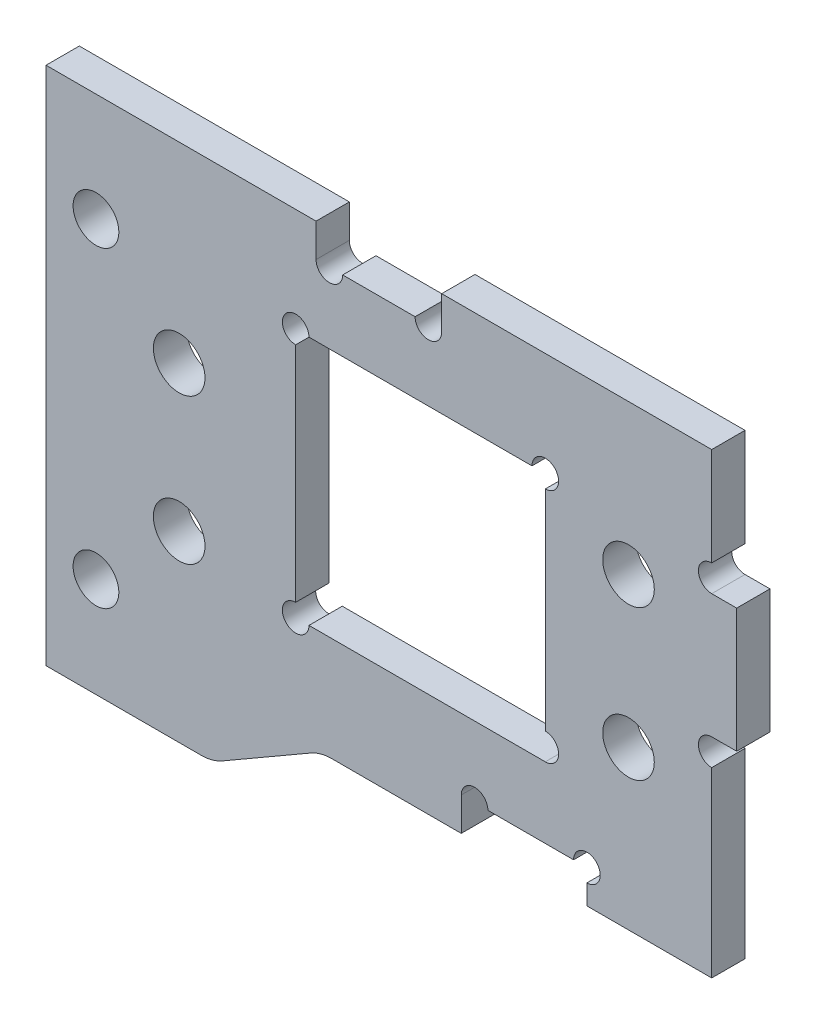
ISO-10303-21;
HEADER;
FILE_DESCRIPTION(('STEP AP214'),'2;1');
FILE_NAME('part.step','',(''),(''),'','','');
FILE_SCHEMA(('AUTOMOTIVE_DESIGN { 1 0 10303 214 1 1 1 1 }'));
ENDSEC;
DATA;
#1=APPLICATION_CONTEXT('core data for automotive mechanical design processes');
#2=APPLICATION_PROTOCOL_DEFINITION('international standard','automotive_design',2000,#1);
#3=PRODUCT_CONTEXT('',#1,'mechanical');
#4=PRODUCT('Part','Part','',(#3));
#5=PRODUCT_RELATED_PRODUCT_CATEGORY('part','',(#4));
#6=PRODUCT_DEFINITION_FORMATION('','',#4);
#7=PRODUCT_DEFINITION_CONTEXT('part definition',#1,'design');
#8=PRODUCT_DEFINITION('design','',#6,#7);
#9=PRODUCT_DEFINITION_SHAPE('','',#8);
#10=(LENGTH_UNIT() NAMED_UNIT(*) SI_UNIT(.MILLI.,.METRE.));
#11=(NAMED_UNIT(*) PLANE_ANGLE_UNIT() SI_UNIT($,.RADIAN.));
#12=(NAMED_UNIT(*) SI_UNIT($,.STERADIAN.) SOLID_ANGLE_UNIT());
#13=UNCERTAINTY_MEASURE_WITH_UNIT(LENGTH_MEASURE(1.E-05),#10,'distance_accuracy_value','');
#14=(GEOMETRIC_REPRESENTATION_CONTEXT(3) GLOBAL_UNCERTAINTY_ASSIGNED_CONTEXT((#13)) GLOBAL_UNIT_ASSIGNED_CONTEXT((#10,
#11,#12)) REPRESENTATION_CONTEXT('',''));
#15=CARTESIAN_POINT('',(0.,0.,0.));
#16=DIRECTION('',(0.,0.,1.));
#17=DIRECTION('',(1.,0.,0.));
#18=AXIS2_PLACEMENT_3D('',#15,#16,#17);
#19=CARTESIAN_POINT('',(40.,-0.25,-6.));
#20=DIRECTION('',(0.,0.,1.));
#21=DIRECTION('',(1.,0.,0.));
#22=AXIS2_PLACEMENT_3D('',#19,#20,#21);
#23=CYLINDRICAL_SURFACE('',#22,1.6);
#24=CARTESIAN_POINT('',(40.,-0.25,0.));
#25=DIRECTION('',(0.,0.,1.));
#26=DIRECTION('',(1.,0.,0.));
#27=AXIS2_PLACEMENT_3D('',#24,#25,#26);
#28=CIRCLE('',#27,1.6);
#29=CARTESIAN_POINT('',(40.,1.35,0.));
#30=VERTEX_POINT('',#29);
#31=CARTESIAN_POINT('',(40.,-1.85,0.));
#32=VERTEX_POINT('',#31);
#33=EDGE_CURVE('E379',#30,#32,#28,.T.);
#34=ORIENTED_EDGE('',*,*,#33,.F.);
#35=DIRECTION('',(0.,0.,-1.));
#36=VECTOR('',#35,1.);
#37=CARTESIAN_POINT('',(40.,1.35,4.));
#38=LINE('',#37,#36);
#39=CARTESIAN_POINT('',(40.,1.35,4.));
#40=VERTEX_POINT('',#39);
#41=EDGE_CURVE('E465',#40,#30,#38,.T.);
#42=ORIENTED_EDGE('',*,*,#41,.F.);
#43=CARTESIAN_POINT('',(40.,-0.25,4.));
#44=DIRECTION('',(0.,0.,1.));
#45=DIRECTION('',(1.,0.,0.));
#46=AXIS2_PLACEMENT_3D('',#43,#44,#45);
#47=CIRCLE('',#46,1.6);
#48=CARTESIAN_POINT('',(40.,-1.85,4.));
#49=VERTEX_POINT('',#48);
#50=EDGE_CURVE('E643',#40,#49,#47,.T.);
#51=ORIENTED_EDGE('',*,*,#50,.T.);
#52=DIRECTION('',(0.,0.,1.));
#53=VECTOR('',#52,1.);
#54=CARTESIAN_POINT('',(40.,-1.85,-6.));
#55=LINE('',#54,#53);
#56=EDGE_CURVE('E605',#32,#49,#55,.T.);
#57=ORIENTED_EDGE('',*,*,#56,.F.);
#58=EDGE_LOOP('',(#34,#42,#51,#57));
#59=FACE_BOUND('',#58,.T.);
#60=ADVANCED_FACE('F17',(#59),#23,.F.);
#61=CARTESIAN_POINT('',(40.,17.85,-6.));
#62=DIRECTION('',(0.,0.,1.));
#63=DIRECTION('',(1.,0.,0.));
#64=AXIS2_PLACEMENT_3D('',#61,#62,#63);
#65=CYLINDRICAL_SURFACE('',#64,1.6);
#66=CARTESIAN_POINT('',(40.,17.85,0.));
#67=DIRECTION('',(0.,0.,1.));
#68=DIRECTION('',(1.,0.,0.));
#69=AXIS2_PLACEMENT_3D('',#66,#67,#68);
#70=CIRCLE('',#69,1.6);
#71=CARTESIAN_POINT('',(40.,19.45,0.));
#72=VERTEX_POINT('',#71);
#73=CARTESIAN_POINT('',(40.,16.25,0.));
#74=VERTEX_POINT('',#73);
#75=EDGE_CURVE('E452',#72,#74,#70,.T.);
#76=ORIENTED_EDGE('',*,*,#75,.F.);
#77=DIRECTION('',(0.,0.,-1.));
#78=VECTOR('',#77,1.);
#79=CARTESIAN_POINT('',(40.,19.45,-6.));
#80=LINE('',#79,#78);
#81=CARTESIAN_POINT('',(40.,19.45,4.));
#82=VERTEX_POINT('',#81);
#83=EDGE_CURVE('E437',#82,#72,#80,.T.);
#84=ORIENTED_EDGE('',*,*,#83,.F.);
#85=CARTESIAN_POINT('',(40.,17.85,4.));
#86=DIRECTION('',(0.,0.,1.));
#87=DIRECTION('',(1.,0.,0.));
#88=AXIS2_PLACEMENT_3D('',#85,#86,#87);
#89=CIRCLE('',#88,1.6);
#90=CARTESIAN_POINT('',(40.,16.25,4.));
#91=VERTEX_POINT('',#90);
#92=EDGE_CURVE('E336',#82,#91,#89,.T.);
#93=ORIENTED_EDGE('',*,*,#92,.T.);
#94=DIRECTION('',(0.,0.,-1.));
#95=VECTOR('',#94,1.);
#96=CARTESIAN_POINT('',(40.,16.25,4.));
#97=LINE('',#96,#95);
#98=EDGE_CURVE('E472',#91,#74,#97,.T.);
#99=ORIENTED_EDGE('',*,*,#98,.T.);
#100=EDGE_LOOP('',(#76,#84,#93,#99));
#101=FACE_BOUND('',#100,.T.);
#102=ADVANCED_FACE('F674',(#101),#65,.F.);
#103=CARTESIAN_POINT('',(5.95,27.25,-6.));
#104=DIRECTION('',(0.,0.,1.));
#105=DIRECTION('',(1.,0.,0.));
#106=AXIS2_PLACEMENT_3D('',#103,#104,#105);
#107=CYLINDRICAL_SURFACE('',#106,1.6);
#108=DIRECTION('',(0.,0.,1.));
#109=VECTOR('',#108,1.);
#110=CARTESIAN_POINT('',(4.35,27.25,-6.));
#111=LINE('',#110,#109);
#112=CARTESIAN_POINT('',(4.35,27.25,0.));
#113=VERTEX_POINT('',#112);
#114=CARTESIAN_POINT('',(4.35,27.25,4.));
#115=VERTEX_POINT('',#114);
#116=EDGE_CURVE('E483',#113,#115,#111,.T.);
#117=ORIENTED_EDGE('',*,*,#116,.T.);
#118=CARTESIAN_POINT('',(5.95,27.25,4.));
#119=DIRECTION('',(0.,0.,1.));
#120=DIRECTION('',(1.,0.,0.));
#121=AXIS2_PLACEMENT_3D('',#118,#119,#120);
#122=CIRCLE('',#121,1.6);
#123=CARTESIAN_POINT('',(7.55,27.25,4.));
#124=VERTEX_POINT('',#123);
#125=EDGE_CURVE('E356',#115,#124,#122,.T.);
#126=ORIENTED_EDGE('',*,*,#125,.T.);
#127=DIRECTION('',(0.,0.,-1.));
#128=VECTOR('',#127,1.);
#129=CARTESIAN_POINT('',(7.55,27.25,4.));
#130=LINE('',#129,#128);
#131=CARTESIAN_POINT('',(7.55,27.25,0.));
#132=VERTEX_POINT('',#131);
#133=EDGE_CURVE('E479',#124,#132,#130,.T.);
#134=ORIENTED_EDGE('',*,*,#133,.T.);
#135=CARTESIAN_POINT('',(5.95,27.25,0.));
#136=DIRECTION('',(0.,0.,1.));
#137=DIRECTION('',(1.,0.,0.));
#138=AXIS2_PLACEMENT_3D('',#135,#136,#137);
#139=CIRCLE('',#138,1.6);
#140=EDGE_CURVE('E421',#113,#132,#139,.T.);
#141=ORIENTED_EDGE('',*,*,#140,.F.);
#142=EDGE_LOOP('',(#117,#126,#134,#141));
#143=FACE_BOUND('',#142,.T.);
#144=ADVANCED_FACE('F693',(#143),#107,.F.);
#145=CARTESIAN_POINT('',(-5.95,27.25,-6.));
#146=DIRECTION('',(0.,0.,1.));
#147=DIRECTION('',(1.,0.,0.));
#148=AXIS2_PLACEMENT_3D('',#145,#146,#147);
#149=CYLINDRICAL_SURFACE('',#148,1.6);
#150=DIRECTION('',(0.,0.,-1.));
#151=VECTOR('',#150,1.);
#152=CARTESIAN_POINT('',(-4.35,27.25,-6.));
#153=LINE('',#152,#151);
#154=CARTESIAN_POINT('',(-4.35,27.25,4.));
#155=VERTEX_POINT('',#154);
#156=CARTESIAN_POINT('',(-4.35,27.25,0.));
#157=VERTEX_POINT('',#156);
#158=EDGE_CURVE('E482',#155,#157,#153,.T.);
#159=ORIENTED_EDGE('',*,*,#158,.T.);
#160=CARTESIAN_POINT('',(-5.95,27.25,0.));
#161=DIRECTION('',(0.,0.,1.));
#162=DIRECTION('',(1.,0.,0.));
#163=AXIS2_PLACEMENT_3D('',#160,#161,#162);
#164=CIRCLE('',#163,1.6);
#165=CARTESIAN_POINT('',(-7.55,27.25,0.));
#166=VERTEX_POINT('',#165);
#167=EDGE_CURVE('E422',#166,#157,#164,.T.);
#168=ORIENTED_EDGE('',*,*,#167,.F.);
#169=DIRECTION('',(0.,0.,-1.));
#170=VECTOR('',#169,1.);
#171=CARTESIAN_POINT('',(-7.55,27.25,4.));
#172=LINE('',#171,#170);
#173=CARTESIAN_POINT('',(-7.55,27.25,4.));
#174=VERTEX_POINT('',#173);
#175=EDGE_CURVE('E489',#174,#166,#172,.T.);
#176=ORIENTED_EDGE('',*,*,#175,.F.);
#177=CARTESIAN_POINT('',(-5.95,27.25,4.));
#178=DIRECTION('',(0.,0.,1.));
#179=DIRECTION('',(1.,0.,0.));
#180=AXIS2_PLACEMENT_3D('',#177,#178,#179);
#181=CIRCLE('',#180,1.6);
#182=EDGE_CURVE('E357',#174,#155,#181,.T.);
#183=ORIENTED_EDGE('',*,*,#182,.T.);
#184=EDGE_LOOP('',(#159,#168,#176,#183));
#185=FACE_BOUND('',#184,.T.);
#186=ADVANCED_FACE('F815',(#185),#149,.F.);
#187=CARTESIAN_POINT('',(11.5,-19.75,-6.));
#188=DIRECTION('',(0.,0.,1.));
#189=DIRECTION('',(1.,0.,0.));
#190=AXIS2_PLACEMENT_3D('',#187,#188,#189);
#191=CYLINDRICAL_SURFACE('',#190,1.6);
#192=CARTESIAN_POINT('',(11.5,-19.75,0.));
#193=DIRECTION('',(0.,0.,1.));
#194=DIRECTION('',(1.,0.,0.));
#195=AXIS2_PLACEMENT_3D('',#192,#193,#194);
#196=CIRCLE('',#195,1.6);
#197=CARTESIAN_POINT('',(13.1,-19.75,0.));
#198=VERTEX_POINT('',#197);
#199=CARTESIAN_POINT('',(9.9,-19.75,0.));
#200=VERTEX_POINT('',#199);
#201=EDGE_CURVE('E621',#198,#200,#196,.T.);
#202=ORIENTED_EDGE('',*,*,#201,.F.);
#203=DIRECTION('',(0.,0.,-1.));
#204=VECTOR('',#203,1.);
#205=CARTESIAN_POINT('',(13.1,-19.75,-6.));
#206=LINE('',#205,#204);
#207=CARTESIAN_POINT('',(13.1,-19.75,4.));
#208=VERTEX_POINT('',#207);
#209=EDGE_CURVE('E507',#208,#198,#206,.T.);
#210=ORIENTED_EDGE('',*,*,#209,.F.);
#211=CARTESIAN_POINT('',(11.5,-19.75,4.));
#212=DIRECTION('',(0.,0.,1.));
#213=DIRECTION('',(1.,0.,0.));
#214=AXIS2_PLACEMENT_3D('',#211,#212,#213);
#215=CIRCLE('',#214,1.6);
#216=CARTESIAN_POINT('',(9.9,-19.75,4.));
#217=VERTEX_POINT('',#216);
#218=EDGE_CURVE('E394',#208,#217,#215,.T.);
#219=ORIENTED_EDGE('',*,*,#218,.T.);
#220=DIRECTION('',(0.,0.,1.));
#221=VECTOR('',#220,1.);
#222=CARTESIAN_POINT('',(9.9,-19.75,0.));
#223=LINE('',#222,#221);
#224=EDGE_CURVE('E504',#200,#217,#223,.T.);
#225=ORIENTED_EDGE('',*,*,#224,.F.);
#226=EDGE_LOOP('',(#202,#210,#219,#225));
#227=FACE_BOUND('',#226,.T.);
#228=ADVANCED_FACE('F807',(#227),#191,.F.);
#229=CARTESIAN_POINT('',(-10.,18.75,-6.));
#230=DIRECTION('',(0.,0.,1.));
#231=DIRECTION('',(1.,0.,0.));
#232=AXIS2_PLACEMENT_3D('',#229,#230,#231);
#233=CYLINDRICAL_SURFACE('',#232,1.6);
#234=CARTESIAN_POINT('',(-10.,18.75,0.));
#235=DIRECTION('',(0.,0.,1.));
#236=DIRECTION('',(1.,0.,0.));
#237=AXIS2_PLACEMENT_3D('',#234,#235,#236);
#238=CIRCLE('',#237,1.6);
#239=CARTESIAN_POINT('',(-8.4,18.75,0.));
#240=VERTEX_POINT('',#239);
#241=CARTESIAN_POINT('',(-10.,17.15,0.));
#242=VERTEX_POINT('',#241);
#243=EDGE_CURVE('E319',#240,#242,#238,.T.);
#244=ORIENTED_EDGE('',*,*,#243,.F.);
#245=DIRECTION('',(0.,0.,-1.));
#246=VECTOR('',#245,1.);
#247=CARTESIAN_POINT('',(-8.4,18.75,-6.));
#248=LINE('',#247,#246);
#249=CARTESIAN_POINT('',(-8.4,18.75,4.));
#250=VERTEX_POINT('',#249);
#251=EDGE_CURVE('E305',#250,#240,#248,.T.);
#252=ORIENTED_EDGE('',*,*,#251,.F.);
#253=CARTESIAN_POINT('',(-10.,18.75,4.));
#254=DIRECTION('',(0.,0.,1.));
#255=DIRECTION('',(1.,0.,0.));
#256=AXIS2_PLACEMENT_3D('',#253,#254,#255);
#257=CIRCLE('',#256,1.6);
#258=CARTESIAN_POINT('',(-10.,17.15,4.));
#259=VERTEX_POINT('',#258);
#260=EDGE_CURVE('E399',#250,#259,#257,.T.);
#261=ORIENTED_EDGE('',*,*,#260,.T.);
#262=DIRECTION('',(0.,0.,1.));
#263=VECTOR('',#262,1.);
#264=CARTESIAN_POINT('',(-10.,17.15,-6.));
#265=LINE('',#264,#263);
#266=EDGE_CURVE('E285',#242,#259,#265,.T.);
#267=ORIENTED_EDGE('',*,*,#266,.F.);
#268=EDGE_LOOP('',(#244,#252,#261,#267));
#269=FACE_BOUND('',#268,.T.);
#270=ADVANCED_FACE('F805',(#269),#233,.F.);
#271=CARTESIAN_POINT('',(-10.,-11.25,-6.));
#272=DIRECTION('',(0.,0.,1.));
#273=DIRECTION('',(1.,0.,0.));
#274=AXIS2_PLACEMENT_3D('',#271,#272,#273);
#275=CYLINDRICAL_SURFACE('',#274,1.6);
#276=CARTESIAN_POINT('',(-10.,-11.25,4.));
#277=DIRECTION('',(0.,0.,1.));
#278=DIRECTION('',(1.,0.,0.));
#279=AXIS2_PLACEMENT_3D('',#276,#277,#278);
#280=CIRCLE('',#279,1.6);
#281=CARTESIAN_POINT('',(-10.,-9.65,4.));
#282=VERTEX_POINT('',#281);
#283=CARTESIAN_POINT('',(-8.4,-11.25,4.));
#284=VERTEX_POINT('',#283);
#285=EDGE_CURVE('E348',#282,#284,#280,.T.);
#286=ORIENTED_EDGE('',*,*,#285,.T.);
#287=DIRECTION('',(0.,0.,1.));
#288=VECTOR('',#287,1.);
#289=CARTESIAN_POINT('',(-8.4,-11.25,-6.));
#290=LINE('',#289,#288);
#291=CARTESIAN_POINT('',(-8.4,-11.25,0.));
#292=VERTEX_POINT('',#291);
#293=EDGE_CURVE('E26',#292,#284,#290,.T.);
#294=ORIENTED_EDGE('',*,*,#293,.F.);
#295=CARTESIAN_POINT('',(-10.,-11.25,0.));
#296=DIRECTION('',(0.,0.,1.));
#297=DIRECTION('',(1.,0.,0.));
#298=AXIS2_PLACEMENT_3D('',#295,#296,#297);
#299=CIRCLE('',#298,1.6);
#300=CARTESIAN_POINT('',(-10.,-9.65,0.));
#301=VERTEX_POINT('',#300);
#302=EDGE_CURVE('E308',#301,#292,#299,.T.);
#303=ORIENTED_EDGE('',*,*,#302,.F.);
#304=DIRECTION('',(0.,0.,-1.));
#305=VECTOR('',#304,1.);
#306=CARTESIAN_POINT('',(-10.,-9.65,-6.));
#307=LINE('',#306,#305);
#308=EDGE_CURVE('E293',#282,#301,#307,.T.);
#309=ORIENTED_EDGE('',*,*,#308,.F.);
#310=EDGE_LOOP('',(#286,#294,#303,#309));
#311=FACE_BOUND('',#310,.T.);
#312=ADVANCED_FACE('F309',(#311),#275,.F.);
#313=CARTESIAN_POINT('',(-10.,-11.25,0.));
#314=DIRECTION('',(0.,-1.,0.));
#315=DIRECTION('',(0.,0.,-1.));
#316=AXIS2_PLACEMENT_3D('',#313,#314,#315);
#317=PLANE('',#316);
#318=DIRECTION('',(1.,0.,0.));
#319=VECTOR('',#318,1.);
#320=CARTESIAN_POINT('',(-10.,-11.25,0.));
#321=LINE('',#320,#319);
#322=CARTESIAN_POINT('',(20.,-11.25,0.));
#323=VERTEX_POINT('',#322);
#324=EDGE_CURVE('E314',#292,#323,#321,.T.);
#325=ORIENTED_EDGE('',*,*,#324,.F.);
#326=ORIENTED_EDGE('',*,*,#293,.T.);
#327=DIRECTION('',(1.,0.,0.));
#328=VECTOR('',#327,1.);
#329=CARTESIAN_POINT('',(-10.,-11.25,4.));
#330=LINE('',#329,#328);
#331=CARTESIAN_POINT('',(20.,-11.25,4.));
#332=VERTEX_POINT('',#331);
#333=EDGE_CURVE('E413',#284,#332,#330,.T.);
#334=ORIENTED_EDGE('',*,*,#333,.T.);
#335=DIRECTION('',(0.,0.,1.));
#336=VECTOR('',#335,1.);
#337=CARTESIAN_POINT('',(20.,-11.25,0.));
#338=LINE('',#337,#336);
#339=EDGE_CURVE('E11',#323,#332,#338,.T.);
#340=ORIENTED_EDGE('',*,*,#339,.F.);
#341=EDGE_LOOP('',(#325,#326,#334,#340));
#342=FACE_BOUND('',#341,.T.);
#343=ADVANCED_FACE('F524',(#342),#317,.F.);
#344=CARTESIAN_POINT('',(20.,18.75,0.));
#345=DIRECTION('',(1.,0.,0.));
#346=DIRECTION('',(0.,1.,0.));
#347=AXIS2_PLACEMENT_3D('',#344,#345,#346);
#348=PLANE('',#347);
#349=DIRECTION('',(0.,1.,0.));
#350=VECTOR('',#349,1.);
#351=CARTESIAN_POINT('',(20.,18.75,4.));
#352=LINE('',#351,#350);
#353=CARTESIAN_POINT('',(20.,-8.05,4.));
#354=VERTEX_POINT('',#353);
#355=CARTESIAN_POINT('',(20.,17.15,4.));
#356=VERTEX_POINT('',#355);
#357=EDGE_CURVE('E409',#354,#356,#352,.T.);
#358=ORIENTED_EDGE('',*,*,#357,.T.);
#359=DIRECTION('',(0.,0.,-1.));
#360=VECTOR('',#359,1.);
#361=CARTESIAN_POINT('',(20.,17.15,-6.));
#362=LINE('',#361,#360);
#363=CARTESIAN_POINT('',(20.,17.15,0.));
#364=VERTEX_POINT('',#363);
#365=EDGE_CURVE('E518',#356,#364,#362,.T.);
#366=ORIENTED_EDGE('',*,*,#365,.T.);
#367=DIRECTION('',(0.,1.,0.));
#368=VECTOR('',#367,1.);
#369=CARTESIAN_POINT('',(20.,18.75,0.));
#370=LINE('',#369,#368);
#371=CARTESIAN_POINT('',(20.,-8.05,0.));
#372=VERTEX_POINT('',#371);
#373=EDGE_CURVE('E464',#372,#364,#370,.T.);
#374=ORIENTED_EDGE('',*,*,#373,.F.);
#375=DIRECTION('',(0.,0.,1.));
#376=VECTOR('',#375,1.);
#377=CARTESIAN_POINT('',(20.,-8.05,-6.));
#378=LINE('',#377,#376);
#379=EDGE_CURVE('E539',#372,#354,#378,.T.);
#380=ORIENTED_EDGE('',*,*,#379,.T.);
#381=EDGE_LOOP('',(#358,#366,#374,#380));
#382=FACE_BOUND('',#381,.T.);
#383=ADVANCED_FACE('F866',(#382),#348,.F.);
#384=CARTESIAN_POINT('',(-10.,18.75,0.));
#385=DIRECTION('',(0.,1.,0.));
#386=DIRECTION('',(1.,0.,0.));
#387=AXIS2_PLACEMENT_3D('',#384,#385,#386);
#388=PLANE('',#387);
#389=DIRECTION('',(-1.,0.,0.));
#390=VECTOR('',#389,1.);
#391=CARTESIAN_POINT('',(-10.,18.75,4.));
#392=LINE('',#391,#390);
#393=CARTESIAN_POINT('',(18.4,18.75,4.));
#394=VERTEX_POINT('',#393);
#395=EDGE_CURVE('E401',#394,#250,#392,.T.);
#396=ORIENTED_EDGE('',*,*,#395,.T.);
#397=ORIENTED_EDGE('',*,*,#251,.T.);
#398=DIRECTION('',(-1.,0.,0.));
#399=VECTOR('',#398,1.);
#400=CARTESIAN_POINT('',(-10.,18.75,0.));
#401=LINE('',#400,#399);
#402=CARTESIAN_POINT('',(18.4,18.75,0.));
#403=VERTEX_POINT('',#402);
#404=EDGE_CURVE('E326',#403,#240,#401,.T.);
#405=ORIENTED_EDGE('',*,*,#404,.F.);
#406=DIRECTION('',(0.,0.,1.));
#407=VECTOR('',#406,1.);
#408=CARTESIAN_POINT('',(18.4,18.75,-6.));
#409=LINE('',#408,#407);
#410=EDGE_CURVE('E546',#403,#394,#409,.T.);
#411=ORIENTED_EDGE('',*,*,#410,.T.);
#412=EDGE_LOOP('',(#396,#397,#405,#411));
#413=FACE_BOUND('',#412,.T.);
#414=ADVANCED_FACE('F803',(#413),#388,.F.);
#415=CARTESIAN_POINT('',(-10.,18.75,0.));
#416=DIRECTION('',(-1.,0.,0.));
#417=DIRECTION('',(0.,1.,0.));
#418=AXIS2_PLACEMENT_3D('',#415,#416,#417);
#419=PLANE('',#418);
#420=DIRECTION('',(0.,-1.,0.));
#421=VECTOR('',#420,1.);
#422=CARTESIAN_POINT('',(-10.,18.75,0.));
#423=LINE('',#422,#421);
#424=EDGE_CURVE('E297',#242,#301,#423,.T.);
#425=ORIENTED_EDGE('',*,*,#424,.F.);
#426=ORIENTED_EDGE('',*,*,#266,.T.);
#427=DIRECTION('',(0.,-1.,0.));
#428=VECTOR('',#427,1.);
#429=CARTESIAN_POINT('',(-10.,18.75,4.));
#430=LINE('',#429,#428);
#431=EDGE_CURVE('E300',#259,#282,#430,.T.);
#432=ORIENTED_EDGE('',*,*,#431,.T.);
#433=ORIENTED_EDGE('',*,*,#308,.T.);
#434=EDGE_LOOP('',(#425,#426,#432,#433));
#435=FACE_BOUND('',#434,.T.);
#436=ADVANCED_FACE('F295',(#435),#419,.F.);
#437=CARTESIAN_POINT('',(25.,-23.75,0.));
#438=DIRECTION('',(1.,0.,0.));
#439=DIRECTION('',(0.,1.,0.));
#440=AXIS2_PLACEMENT_3D('',#437,#438,#439);
#441=PLANE('',#440);
#442=DIRECTION('',(0.,1.,0.));
#443=VECTOR('',#442,1.);
#444=CARTESIAN_POINT('',(25.,-23.75,4.));
#445=LINE('',#444,#443);
#446=CARTESIAN_POINT('',(25.,-23.75,4.));
#447=VERTEX_POINT('',#446);
#448=CARTESIAN_POINT('',(25.,-21.35,4.));
#449=VERTEX_POINT('',#448);
#450=EDGE_CURVE('E585',#447,#449,#445,.T.);
#451=ORIENTED_EDGE('',*,*,#450,.T.);
#452=DIRECTION('',(0.,0.,-1.));
#453=VECTOR('',#452,1.);
#454=CARTESIAN_POINT('',(25.,-21.35,-6.));
#455=LINE('',#454,#453);
#456=CARTESIAN_POINT('',(25.,-21.35,0.));
#457=VERTEX_POINT('',#456);
#458=EDGE_CURVE('E510',#449,#457,#455,.T.);
#459=ORIENTED_EDGE('',*,*,#458,.T.);
#460=DIRECTION('',(0.,1.,0.));
#461=VECTOR('',#460,1.);
#462=CARTESIAN_POINT('',(25.,-23.75,0.));
#463=LINE('',#462,#461);
#464=CARTESIAN_POINT('',(25.,-23.75,0.));
#465=VERTEX_POINT('',#464);
#466=EDGE_CURVE('E347',#465,#457,#463,.T.);
#467=ORIENTED_EDGE('',*,*,#466,.F.);
#468=DIRECTION('',(0.,0.,1.));
#469=VECTOR('',#468,1.);
#470=CARTESIAN_POINT('',(25.,-23.75,0.));
#471=LINE('',#470,#469);
#472=EDGE_CURVE('E501',#465,#447,#471,.T.);
#473=ORIENTED_EDGE('',*,*,#472,.T.);
#474=EDGE_LOOP('',(#451,#459,#467,#473));
#475=FACE_BOUND('',#474,.T.);
#476=ADVANCED_FACE('F776',(#475),#441,.F.);
#477=CARTESIAN_POINT('',(9.9,-19.75,0.));
#478=DIRECTION('',(0.,1.,0.));
#479=DIRECTION('',(1.,0.,0.));
#480=AXIS2_PLACEMENT_3D('',#477,#478,#479);
#481=PLANE('',#480);
#482=DIRECTION('',(-1.,0.,0.));
#483=VECTOR('',#482,1.);
#484=CARTESIAN_POINT('',(9.9,-19.75,0.));
#485=LINE('',#484,#483);
#486=CARTESIAN_POINT('',(23.4,-19.75,0.));
#487=VERTEX_POINT('',#486);
#488=EDGE_CURVE('E426',#487,#198,#485,.T.);
#489=ORIENTED_EDGE('',*,*,#488,.F.);
#490=DIRECTION('',(0.,0.,1.));
#491=VECTOR('',#490,1.);
#492=CARTESIAN_POINT('',(23.4,-19.75,-6.));
#493=LINE('',#492,#491);
#494=CARTESIAN_POINT('',(23.4,-19.75,4.));
#495=VERTEX_POINT('',#494);
#496=EDGE_CURVE('E747',#487,#495,#493,.T.);
#497=ORIENTED_EDGE('',*,*,#496,.T.);
#498=DIRECTION('',(-1.,0.,0.));
#499=VECTOR('',#498,1.);
#500=CARTESIAN_POINT('',(9.9,-19.75,4.));
#501=LINE('',#500,#499);
#502=EDGE_CURVE('E398',#495,#208,#501,.T.);
#503=ORIENTED_EDGE('',*,*,#502,.T.);
#504=ORIENTED_EDGE('',*,*,#209,.T.);
#505=EDGE_LOOP('',(#489,#497,#503,#504));
#506=FACE_BOUND('',#505,.T.);
#507=ADVANCED_FACE('F862',(#506),#481,.F.);
#508=CARTESIAN_POINT('',(9.9,-23.75,0.));
#509=DIRECTION('',(-1.,0.,0.));
#510=DIRECTION('',(0.,0.,1.));
#511=AXIS2_PLACEMENT_3D('',#508,#509,#510);
#512=PLANE('',#511);
#513=DIRECTION('',(0.,-1.,0.));
#514=VECTOR('',#513,1.);
#515=CARTESIAN_POINT('',(9.9,-23.75,4.));
#516=LINE('',#515,#514);
#517=CARTESIAN_POINT('',(9.9,-23.75,4.));
#518=VERTEX_POINT('',#517);
#519=EDGE_CURVE('E385',#217,#518,#516,.T.);
#520=ORIENTED_EDGE('',*,*,#519,.T.);
#521=DIRECTION('',(0.,0.,1.));
#522=VECTOR('',#521,1.);
#523=CARTESIAN_POINT('',(9.9,-23.75,0.));
#524=LINE('',#523,#522);
#525=CARTESIAN_POINT('',(9.9,-23.75,0.));
#526=VERTEX_POINT('',#525);
#527=EDGE_CURVE('E590',#526,#518,#524,.T.);
#528=ORIENTED_EDGE('',*,*,#527,.F.);
#529=DIRECTION('',(0.,-1.,0.));
#530=VECTOR('',#529,1.);
#531=CARTESIAN_POINT('',(9.9,-23.75,0.));
#532=LINE('',#531,#530);
#533=EDGE_CURVE('E625',#200,#526,#532,.T.);
#534=ORIENTED_EDGE('',*,*,#533,.F.);
#535=ORIENTED_EDGE('',*,*,#224,.T.);
#536=EDGE_LOOP('',(#520,#528,#534,#535));
#537=FACE_BOUND('',#536,.T.);
#538=ADVANCED_FACE('F858',(#537),#512,.F.);
#539=CARTESIAN_POINT('',(-21.3397459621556,-26.25,4.));
#540=DIRECTION('',(0.,0.,-1.));
#541=DIRECTION('',(-1.,0.,0.));
#542=AXIS2_PLACEMENT_3D('',#539,#540,#541);
#543=CYLINDRICAL_SURFACE('',#542,5.);
#544=CARTESIAN_POINT('',(-21.3397459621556,-26.25,0.));
#545=DIRECTION('',(0.,0.,-1.));
#546=DIRECTION('',(1.,0.,0.));
#547=AXIS2_PLACEMENT_3D('',#544,#545,#546);
#548=CIRCLE('',#547,5.);
#549=CARTESIAN_POINT('',(-18.8397459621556,-30.5801270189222,0.));
#550=VERTEX_POINT('',#549);
#551=CARTESIAN_POINT('',(-21.3397459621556,-31.25,0.));
#552=VERTEX_POINT('',#551);
#553=EDGE_CURVE('E407',#550,#552,#548,.T.);
#554=ORIENTED_EDGE('',*,*,#553,.F.);
#555=DIRECTION('',(0.,0.,-1.));
#556=VECTOR('',#555,1.);
#557=CARTESIAN_POINT('',(-18.8397459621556,-30.5801270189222,0.));
#558=LINE('',#557,#556);
#559=CARTESIAN_POINT('',(-18.8397459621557,-30.5801270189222,4.));
#560=VERTEX_POINT('',#559);
#561=EDGE_CURVE('E498',#560,#550,#558,.T.);
#562=ORIENTED_EDGE('',*,*,#561,.F.);
#563=CARTESIAN_POINT('',(-21.3397459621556,-26.25,4.));
#564=DIRECTION('',(0.,0.,1.));
#565=DIRECTION('',(1.,0.,0.));
#566=AXIS2_PLACEMENT_3D('',#563,#564,#565);
#567=CIRCLE('',#566,5.);
#568=CARTESIAN_POINT('',(-21.3397459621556,-31.25,4.));
#569=VERTEX_POINT('',#568);
#570=EDGE_CURVE('E374',#569,#560,#567,.T.);
#571=ORIENTED_EDGE('',*,*,#570,.F.);
#572=DIRECTION('',(0.,0.,1.));
#573=VECTOR('',#572,1.);
#574=CARTESIAN_POINT('',(-21.3397459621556,-31.25,4.));
#575=LINE('',#574,#573);
#576=EDGE_CURVE('E601',#552,#569,#575,.T.);
#577=ORIENTED_EDGE('',*,*,#576,.F.);
#578=EDGE_LOOP('',(#554,#562,#571,#577));
#579=FACE_BOUND('',#578,.T.);
#580=ADVANCED_FACE('F855',(#579),#543,.T.);
#581=CARTESIAN_POINT('',(-5.66987298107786,-28.75,-6.));
#582=DIRECTION('',(0.,0.,-1.));
#583=DIRECTION('',(-1.,0.,0.));
#584=AXIS2_PLACEMENT_3D('',#581,#582,#583);
#585=CYLINDRICAL_SURFACE('',#584,5.);
#586=CARTESIAN_POINT('',(-5.66987298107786,-28.75,0.));
#587=DIRECTION('',(0.,0.,1.));
#588=DIRECTION('',(1.,0.,0.));
#589=AXIS2_PLACEMENT_3D('',#586,#587,#588);
#590=CIRCLE('',#589,5.);
#591=CARTESIAN_POINT('',(-5.66987298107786,-23.75,0.));
#592=VERTEX_POINT('',#591);
#593=CARTESIAN_POINT('',(-8.16987298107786,-24.4198729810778,0.));
#594=VERTEX_POINT('',#593);
#595=EDGE_CURVE('E408',#592,#594,#590,.T.);
#596=ORIENTED_EDGE('',*,*,#595,.F.);
#597=DIRECTION('',(0.,0.,-1.));
#598=VECTOR('',#597,1.);
#599=CARTESIAN_POINT('',(-5.66987298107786,-23.75,0.));
#600=LINE('',#599,#598);
#601=CARTESIAN_POINT('',(-5.66987298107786,-23.75,4.));
#602=VERTEX_POINT('',#601);
#603=EDGE_CURVE('E591',#602,#592,#600,.T.);
#604=ORIENTED_EDGE('',*,*,#603,.F.);
#605=CARTESIAN_POINT('',(-5.66987298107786,-28.75,4.));
#606=DIRECTION('',(0.,0.,-1.));
#607=DIRECTION('',(1.,0.,0.));
#608=AXIS2_PLACEMENT_3D('',#605,#606,#607);
#609=CIRCLE('',#608,5.);
#610=CARTESIAN_POINT('',(-8.16987298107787,-24.4198729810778,4.));
#611=VERTEX_POINT('',#610);
#612=EDGE_CURVE('E381',#611,#602,#609,.T.);
#613=ORIENTED_EDGE('',*,*,#612,.F.);
#614=DIRECTION('',(0.,0.,1.));
#615=VECTOR('',#614,1.);
#616=CARTESIAN_POINT('',(-8.16987298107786,-24.4198729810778,4.));
#617=LINE('',#616,#615);
#618=EDGE_CURVE('E495',#594,#611,#617,.T.);
#619=ORIENTED_EDGE('',*,*,#618,.F.);
#620=EDGE_LOOP('',(#596,#604,#613,#619));
#621=FACE_BOUND('',#620,.T.);
#622=ADVANCED_FACE('F854',(#621),#585,.F.);
#623=CARTESIAN_POINT('',(0.,-23.75,-6.));
#624=DIRECTION('',(0.,-1.,0.));
#625=DIRECTION('',(0.,0.,-1.));
#626=AXIS2_PLACEMENT_3D('',#623,#624,#625);
#627=PLANE('',#626);
#628=ORIENTED_EDGE('',*,*,#472,.F.);
#629=DIRECTION('',(1.,0.,0.));
#630=VECTOR('',#629,1.);
#631=CARTESIAN_POINT('',(0.,-23.75,0.));
#632=LINE('',#631,#630);
#633=CARTESIAN_POINT('',(40.,-23.75,0.));
#634=VERTEX_POINT('',#633);
#635=EDGE_CURVE('E457',#465,#634,#632,.T.);
#636=ORIENTED_EDGE('',*,*,#635,.T.);
#637=DIRECTION('',(0.,0.,1.));
#638=VECTOR('',#637,1.);
#639=CARTESIAN_POINT('',(40.,-23.75,-6.));
#640=LINE('',#639,#638);
#641=CARTESIAN_POINT('',(40.,-23.75,4.));
#642=VERTEX_POINT('',#641);
#643=EDGE_CURVE('E581',#634,#642,#640,.T.);
#644=ORIENTED_EDGE('',*,*,#643,.T.);
#645=DIRECTION('',(1.,0.,0.));
#646=VECTOR('',#645,1.);
#647=CARTESIAN_POINT('',(0.,-23.75,4.));
#648=LINE('',#647,#646);
#649=EDGE_CURVE('E638',#447,#642,#648,.T.);
#650=ORIENTED_EDGE('',*,*,#649,.F.);
#651=EDGE_LOOP('',(#628,#636,#644,#650));
#652=FACE_BOUND('',#651,.T.);
#653=ADVANCED_FACE('F772',(#652),#627,.T.);
#654=CARTESIAN_POINT('',(8.53164693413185,-14.7772459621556,-6.));
#655=DIRECTION('',(0.5,-0.866025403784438,0.));
#656=DIRECTION('',(0.,0.,-1.));
#657=AXIS2_PLACEMENT_3D('',#654,#655,#656);
#658=PLANE('',#657);
#659=DIRECTION('',(0.866025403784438,0.5,0.));
#660=VECTOR('',#659,1.);
#661=CARTESIAN_POINT('',(8.53164693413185,-14.7772459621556,0.));
#662=LINE('',#661,#660);
#663=EDGE_CURVE('E403',#550,#594,#662,.T.);
#664=ORIENTED_EDGE('',*,*,#663,.T.);
#665=ORIENTED_EDGE('',*,*,#618,.T.);
#666=DIRECTION('',(0.866025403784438,0.5,0.));
#667=VECTOR('',#666,1.);
#668=CARTESIAN_POINT('',(8.53164693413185,-14.7772459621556,4.));
#669=LINE('',#668,#667);
#670=EDGE_CURVE('E386',#560,#611,#669,.T.);
#671=ORIENTED_EDGE('',*,*,#670,.F.);
#672=ORIENTED_EDGE('',*,*,#561,.T.);
#673=EDGE_LOOP('',(#664,#665,#671,#672));
#674=FACE_BOUND('',#673,.T.);
#675=ADVANCED_FACE('F847',(#674),#658,.T.);
#676=CARTESIAN_POINT('',(-40.,0.,4.));
#677=DIRECTION('',(-1.,0.,0.));
#678=DIRECTION('',(0.,0.,1.));
#679=AXIS2_PLACEMENT_3D('',#676,#677,#678);
#680=PLANE('',#679);
#681=DIRECTION('',(0.,1.,0.));
#682=VECTOR('',#681,1.);
#683=CARTESIAN_POINT('',(-40.,0.,0.));
#684=LINE('',#683,#682);
#685=CARTESIAN_POINT('',(-40.,-31.25,0.));
#686=VERTEX_POINT('',#685);
#687=CARTESIAN_POINT('',(-40.,31.25,0.));
#688=VERTEX_POINT('',#687);
#689=EDGE_CURVE('E432',#686,#688,#684,.T.);
#690=ORIENTED_EDGE('',*,*,#689,.F.);
#691=DIRECTION('',(0.,0.,-1.));
#692=VECTOR('',#691,1.);
#693=CARTESIAN_POINT('',(-40.,-31.25,4.));
#694=LINE('',#693,#692);
#695=CARTESIAN_POINT('',(-40.,-31.25,4.));
#696=VERTEX_POINT('',#695);
#697=EDGE_CURVE('E616',#696,#686,#694,.T.);
#698=ORIENTED_EDGE('',*,*,#697,.F.);
#699=DIRECTION('',(0.,1.,0.));
#700=VECTOR('',#699,1.);
#701=CARTESIAN_POINT('',(-40.,0.,4.));
#702=LINE('',#701,#700);
#703=CARTESIAN_POINT('',(-40.,31.25,4.));
#704=VERTEX_POINT('',#703);
#705=EDGE_CURVE('E370',#696,#704,#702,.T.);
#706=ORIENTED_EDGE('',*,*,#705,.T.);
#707=DIRECTION('',(0.,0.,-1.));
#708=VECTOR('',#707,1.);
#709=CARTESIAN_POINT('',(-40.,31.25,4.));
#710=LINE('',#709,#708);
#711=EDGE_CURVE('E492',#704,#688,#710,.T.);
#712=ORIENTED_EDGE('',*,*,#711,.T.);
#713=EDGE_LOOP('',(#690,#698,#706,#712));
#714=FACE_BOUND('',#713,.T.);
#715=ADVANCED_FACE('F843',(#714),#680,.T.);
#716=CARTESIAN_POINT('',(0.,31.25,4.));
#717=DIRECTION('',(0.,1.,0.));
#718=DIRECTION('',(1.,0.,0.));
#719=AXIS2_PLACEMENT_3D('',#716,#717,#718);
#720=PLANE('',#719);
#721=DIRECTION('',(1.,0.,0.));
#722=VECTOR('',#721,1.);
#723=CARTESIAN_POINT('',(0.,31.25,0.));
#724=LINE('',#723,#722);
#725=CARTESIAN_POINT('',(-7.55,31.25,0.));
#726=VERTEX_POINT('',#725);
#727=EDGE_CURVE('E427',#688,#726,#724,.T.);
#728=ORIENTED_EDGE('',*,*,#727,.F.);
#729=ORIENTED_EDGE('',*,*,#711,.F.);
#730=DIRECTION('',(1.,0.,0.));
#731=VECTOR('',#730,1.);
#732=CARTESIAN_POINT('',(0.,31.25,4.));
#733=LINE('',#732,#731);
#734=CARTESIAN_POINT('',(-7.55,31.25,4.));
#735=VERTEX_POINT('',#734);
#736=EDGE_CURVE('E366',#704,#735,#733,.T.);
#737=ORIENTED_EDGE('',*,*,#736,.T.);
#738=DIRECTION('',(0.,0.,-1.));
#739=VECTOR('',#738,1.);
#740=CARTESIAN_POINT('',(-7.55,31.25,4.));
#741=LINE('',#740,#739);
#742=EDGE_CURVE('E486',#735,#726,#741,.T.);
#743=ORIENTED_EDGE('',*,*,#742,.T.);
#744=EDGE_LOOP('',(#728,#729,#737,#743));
#745=FACE_BOUND('',#744,.T.);
#746=ADVANCED_FACE('F839',(#745),#720,.T.);
#747=CARTESIAN_POINT('',(-7.55,0.,4.));
#748=DIRECTION('',(1.,0.,0.));
#749=DIRECTION('',(0.,1.,0.));
#750=AXIS2_PLACEMENT_3D('',#747,#748,#749);
#751=PLANE('',#750);
#752=DIRECTION('',(0.,-1.,0.));
#753=VECTOR('',#752,1.);
#754=CARTESIAN_POINT('',(-7.55,0.,0.));
#755=LINE('',#754,#753);
#756=EDGE_CURVE('E431',#726,#166,#755,.T.);
#757=ORIENTED_EDGE('',*,*,#756,.F.);
#758=ORIENTED_EDGE('',*,*,#742,.F.);
#759=DIRECTION('',(0.,-1.,0.));
#760=VECTOR('',#759,1.);
#761=CARTESIAN_POINT('',(-7.55,0.,4.));
#762=LINE('',#761,#760);
#763=EDGE_CURVE('E361',#735,#174,#762,.T.);
#764=ORIENTED_EDGE('',*,*,#763,.T.);
#765=ORIENTED_EDGE('',*,*,#175,.T.);
#766=EDGE_LOOP('',(#757,#758,#764,#765));
#767=FACE_BOUND('',#766,.T.);
#768=ADVANCED_FACE('F833',(#767),#751,.T.);
#769=CARTESIAN_POINT('',(0.,27.25,4.));
#770=DIRECTION('',(0.,1.,0.));
#771=DIRECTION('',(1.,0.,0.));
#772=AXIS2_PLACEMENT_3D('',#769,#770,#771);
#773=PLANE('',#772);
#774=ORIENTED_EDGE('',*,*,#158,.F.);
#775=DIRECTION('',(1.,0.,0.));
#776=VECTOR('',#775,1.);
#777=CARTESIAN_POINT('',(0.,27.25,4.));
#778=LINE('',#777,#776);
#779=EDGE_CURVE('E362',#155,#115,#778,.T.);
#780=ORIENTED_EDGE('',*,*,#779,.T.);
#781=ORIENTED_EDGE('',*,*,#116,.F.);
#782=DIRECTION('',(1.,0.,0.));
#783=VECTOR('',#782,1.);
#784=CARTESIAN_POINT('',(0.,27.25,0.));
#785=LINE('',#784,#783);
#786=EDGE_CURVE('E417',#157,#113,#785,.T.);
#787=ORIENTED_EDGE('',*,*,#786,.F.);
#788=EDGE_LOOP('',(#774,#780,#781,#787));
#789=FACE_BOUND('',#788,.T.);
#790=ADVANCED_FACE('F830',(#789),#773,.T.);
#791=CARTESIAN_POINT('',(7.55,0.,4.));
#792=DIRECTION('',(1.,0.,0.));
#793=DIRECTION('',(0.,1.,0.));
#794=AXIS2_PLACEMENT_3D('',#791,#792,#793);
#795=PLANE('',#794);
#796=DIRECTION('',(0.,-1.,0.));
#797=VECTOR('',#796,1.);
#798=CARTESIAN_POINT('',(7.55,0.,0.));
#799=LINE('',#798,#797);
#800=CARTESIAN_POINT('',(7.55,31.25,0.));
#801=VERTEX_POINT('',#800);
#802=EDGE_CURVE('E447',#801,#132,#799,.T.);
#803=ORIENTED_EDGE('',*,*,#802,.T.);
#804=ORIENTED_EDGE('',*,*,#133,.F.);
#805=DIRECTION('',(0.,-1.,0.));
#806=VECTOR('',#805,1.);
#807=CARTESIAN_POINT('',(7.55,0.,4.));
#808=LINE('',#807,#806);
#809=CARTESIAN_POINT('',(7.55,31.25,4.));
#810=VERTEX_POINT('',#809);
#811=EDGE_CURVE('E352',#810,#124,#808,.T.);
#812=ORIENTED_EDGE('',*,*,#811,.F.);
#813=DIRECTION('',(0.,0.,-1.));
#814=VECTOR('',#813,1.);
#815=CARTESIAN_POINT('',(7.55,31.25,4.));
#816=LINE('',#815,#814);
#817=EDGE_CURVE('E436',#810,#801,#816,.T.);
#818=ORIENTED_EDGE('',*,*,#817,.T.);
#819=EDGE_LOOP('',(#803,#804,#812,#818));
#820=FACE_BOUND('',#819,.T.);
#821=ADVANCED_FACE('F689',(#820),#795,.F.);
#822=CARTESIAN_POINT('',(0.,31.25,4.));
#823=DIRECTION('',(0.,1.,0.));
#824=DIRECTION('',(1.,0.,0.));
#825=AXIS2_PLACEMENT_3D('',#822,#823,#824);
#826=PLANE('',#825);
#827=DIRECTION('',(1.,0.,0.));
#828=VECTOR('',#827,1.);
#829=CARTESIAN_POINT('',(0.,31.25,0.));
#830=LINE('',#829,#828);
#831=CARTESIAN_POINT('',(40.,31.25,0.));
#832=VERTEX_POINT('',#831);
#833=EDGE_CURVE('E453',#801,#832,#830,.T.);
#834=ORIENTED_EDGE('',*,*,#833,.F.);
#835=ORIENTED_EDGE('',*,*,#817,.F.);
#836=DIRECTION('',(1.,0.,0.));
#837=VECTOR('',#836,1.);
#838=CARTESIAN_POINT('',(0.,31.25,4.));
#839=LINE('',#838,#837);
#840=CARTESIAN_POINT('',(40.,31.25,4.));
#841=VERTEX_POINT('',#840);
#842=EDGE_CURVE('E344',#810,#841,#839,.T.);
#843=ORIENTED_EDGE('',*,*,#842,.T.);
#844=DIRECTION('',(0.,0.,-1.));
#845=VECTOR('',#844,1.);
#846=CARTESIAN_POINT('',(40.,31.25,4.));
#847=LINE('',#846,#845);
#848=EDGE_CURVE('E433',#841,#832,#847,.T.);
#849=ORIENTED_EDGE('',*,*,#848,.T.);
#850=EDGE_LOOP('',(#834,#835,#843,#849));
#851=FACE_BOUND('',#850,.T.);
#852=ADVANCED_FACE('F684',(#851),#826,.T.);
#853=CARTESIAN_POINT('',(40.,0.,4.));
#854=DIRECTION('',(-1.,0.,0.));
#855=DIRECTION('',(0.,0.,1.));
#856=AXIS2_PLACEMENT_3D('',#853,#854,#855);
#857=PLANE('',#856);
#858=DIRECTION('',(0.,1.,0.));
#859=VECTOR('',#858,1.);
#860=CARTESIAN_POINT('',(40.,0.,4.));
#861=LINE('',#860,#859);
#862=EDGE_CURVE('E340',#82,#841,#861,.T.);
#863=ORIENTED_EDGE('',*,*,#862,.F.);
#864=ORIENTED_EDGE('',*,*,#83,.T.);
#865=DIRECTION('',(0.,1.,0.));
#866=VECTOR('',#865,1.);
#867=CARTESIAN_POINT('',(40.,0.,0.));
#868=LINE('',#867,#866);
#869=EDGE_CURVE('E448',#72,#832,#868,.T.);
#870=ORIENTED_EDGE('',*,*,#869,.T.);
#871=ORIENTED_EDGE('',*,*,#848,.F.);
#872=EDGE_LOOP('',(#863,#864,#870,#871));
#873=FACE_BOUND('',#872,.T.);
#874=ADVANCED_FACE('F678',(#873),#857,.F.);
#875=CARTESIAN_POINT('',(0.,16.25,4.));
#876=DIRECTION('',(0.,1.,0.));
#877=DIRECTION('',(1.,0.,0.));
#878=AXIS2_PLACEMENT_3D('',#875,#876,#877);
#879=PLANE('',#878);
#880=DIRECTION('',(1.,0.,0.));
#881=VECTOR('',#880,1.);
#882=CARTESIAN_POINT('',(0.,16.25,0.));
#883=LINE('',#882,#881);
#884=CARTESIAN_POINT('',(43.,16.25,0.));
#885=VERTEX_POINT('',#884);
#886=EDGE_CURVE('E390',#74,#885,#883,.T.);
#887=ORIENTED_EDGE('',*,*,#886,.F.);
#888=ORIENTED_EDGE('',*,*,#98,.F.);
#889=DIRECTION('',(1.,0.,0.));
#890=VECTOR('',#889,1.);
#891=CARTESIAN_POINT('',(0.,16.25,4.));
#892=LINE('',#891,#890);
#893=CARTESIAN_POINT('',(43.,16.25,4.));
#894=VERTEX_POINT('',#893);
#895=EDGE_CURVE('E332',#91,#894,#892,.T.);
#896=ORIENTED_EDGE('',*,*,#895,.T.);
#897=DIRECTION('',(0.,0.,-1.));
#898=VECTOR('',#897,1.);
#899=CARTESIAN_POINT('',(43.,16.25,4.));
#900=LINE('',#899,#898);
#901=EDGE_CURVE('E468',#894,#885,#900,.T.);
#902=ORIENTED_EDGE('',*,*,#901,.T.);
#903=EDGE_LOOP('',(#887,#888,#896,#902));
#904=FACE_BOUND('',#903,.T.);
#905=ADVANCED_FACE('F671',(#904),#879,.T.);
#906=CARTESIAN_POINT('',(43.,0.,4.));
#907=DIRECTION('',(1.,0.,0.));
#908=DIRECTION('',(0.,1.,0.));
#909=AXIS2_PLACEMENT_3D('',#906,#907,#908);
#910=PLANE('',#909);
#911=DIRECTION('',(0.,-1.,0.));
#912=VECTOR('',#911,1.);
#913=CARTESIAN_POINT('',(43.,0.,0.));
#914=LINE('',#913,#912);
#915=CARTESIAN_POINT('',(43.,1.35,0.));
#916=VERTEX_POINT('',#915);
#917=EDGE_CURVE('E380',#885,#916,#914,.T.);
#918=ORIENTED_EDGE('',*,*,#917,.F.);
#919=ORIENTED_EDGE('',*,*,#901,.F.);
#920=DIRECTION('',(0.,-1.,0.));
#921=VECTOR('',#920,1.);
#922=CARTESIAN_POINT('',(43.,0.,4.));
#923=LINE('',#922,#921);
#924=CARTESIAN_POINT('',(43.,1.35,4.));
#925=VERTEX_POINT('',#924);
#926=EDGE_CURVE('E330',#894,#925,#923,.T.);
#927=ORIENTED_EDGE('',*,*,#926,.T.);
#928=DIRECTION('',(0.,0.,-1.));
#929=VECTOR('',#928,1.);
#930=CARTESIAN_POINT('',(43.,1.35,4.));
#931=LINE('',#930,#929);
#932=EDGE_CURVE('E469',#925,#916,#931,.T.);
#933=ORIENTED_EDGE('',*,*,#932,.T.);
#934=EDGE_LOOP('',(#918,#919,#927,#933));
#935=FACE_BOUND('',#934,.T.);
#936=ADVANCED_FACE('F663',(#935),#910,.T.);
#937=CARTESIAN_POINT('',(0.,1.35,4.));
#938=DIRECTION('',(0.,1.,0.));
#939=DIRECTION('',(1.,0.,0.));
#940=AXIS2_PLACEMENT_3D('',#937,#938,#939);
#941=PLANE('',#940);
#942=DIRECTION('',(1.,0.,0.));
#943=VECTOR('',#942,1.);
#944=CARTESIAN_POINT('',(0.,1.35,0.));
#945=LINE('',#944,#943);
#946=EDGE_CURVE('E375',#30,#916,#945,.T.);
#947=ORIENTED_EDGE('',*,*,#946,.T.);
#948=ORIENTED_EDGE('',*,*,#932,.F.);
#949=DIRECTION('',(1.,0.,0.));
#950=VECTOR('',#949,1.);
#951=CARTESIAN_POINT('',(0.,1.35,4.));
#952=LINE('',#951,#950);
#953=EDGE_CURVE('E647',#40,#925,#952,.T.);
#954=ORIENTED_EDGE('',*,*,#953,.F.);
#955=ORIENTED_EDGE('',*,*,#41,.T.);
#956=EDGE_LOOP('',(#947,#948,#954,#955));
#957=FACE_BOUND('',#956,.T.);
#958=ADVANCED_FACE('F1893',(#957),#941,.F.);
#959=CARTESIAN_POINT('',(0.,0.,0.));
#960=DIRECTION('',(0.,0.,1.));
#961=DIRECTION('',(1.,0.,0.));
#962=AXIS2_PLACEMENT_3D('',#959,#960,#961);
#963=PLANE('',#962);
#964=CARTESIAN_POINT('',(-34.,-19.25,0.));
#965=DIRECTION('',(0.,0.,1.));
#966=DIRECTION('',(1.,0.,0.));
#967=AXIS2_PLACEMENT_3D('',#964,#965,#966);
#968=CIRCLE('',#967,2.75);
#969=CARTESIAN_POINT('',(-31.25,-19.25,0.));
#970=VERTEX_POINT('',#969);
#971=EDGE_CURVE('E566',#970,#970,#968,.T.);
#972=ORIENTED_EDGE('',*,*,#971,.T.);
#973=EDGE_LOOP('',(#972));
#974=FACE_BOUND('',#973,.T.);
#975=CARTESIAN_POINT('',(-34.,18.25,0.));
#976=DIRECTION('',(0.,0.,1.));
#977=DIRECTION('',(1.,0.,0.));
#978=AXIS2_PLACEMENT_3D('',#975,#976,#977);
#979=CIRCLE('',#978,2.75);
#980=CARTESIAN_POINT('',(-31.25,18.25,0.));
#981=VERTEX_POINT('',#980);
#982=EDGE_CURVE('E580',#981,#981,#979,.T.);
#983=ORIENTED_EDGE('',*,*,#982,.T.);
#984=EDGE_LOOP('',(#983));
#985=FACE_BOUND('',#984,.T.);
#986=ORIENTED_EDGE('',*,*,#404,.T.);
#987=ORIENTED_EDGE('',*,*,#243,.T.);
#988=ORIENTED_EDGE('',*,*,#424,.T.);
#989=ORIENTED_EDGE('',*,*,#302,.T.);
#990=ORIENTED_EDGE('',*,*,#324,.T.);
#991=CARTESIAN_POINT('',(20.,-9.65,0.));
#992=DIRECTION('',(0.,0.,1.));
#993=DIRECTION('',(1.,0.,0.));
#994=AXIS2_PLACEMENT_3D('',#991,#992,#993);
#995=CIRCLE('',#994,1.6);
#996=EDGE_CURVE('E540',#323,#372,#995,.T.);
#997=ORIENTED_EDGE('',*,*,#996,.T.);
#998=ORIENTED_EDGE('',*,*,#373,.T.);
#999=CARTESIAN_POINT('',(20.,18.75,0.));
#1000=DIRECTION('',(0.,0.,1.));
#1001=DIRECTION('',(1.,0.,0.));
#1002=AXIS2_PLACEMENT_3D('',#999,#1000,#1001);
#1003=CIRCLE('',#1002,1.6);
#1004=EDGE_CURVE('E40',#364,#403,#1003,.T.);
#1005=ORIENTED_EDGE('',*,*,#1004,.T.);
#1006=EDGE_LOOP('',(#986,#987,#988,#989,#990,#997,#998,#1005));
#1007=FACE_BOUND('',#1006,.T.);
#1008=CARTESIAN_POINT('',(30.,-4.75,0.));
#1009=DIRECTION('',(0.,0.,1.));
#1010=DIRECTION('',(1.,0.,0.));
#1011=AXIS2_PLACEMENT_3D('',#1008,#1009,#1010);
#1012=CIRCLE('',#1011,3.1);
#1013=CARTESIAN_POINT('',(33.1,-4.75,0.));
#1014=VERTEX_POINT('',#1013);
#1015=EDGE_CURVE('E724',#1014,#1014,#1012,.T.);
#1016=ORIENTED_EDGE('',*,*,#1015,.T.);
#1017=EDGE_LOOP('',(#1016));
#1018=FACE_BOUND('',#1017,.T.);
#1019=CARTESIAN_POINT('',(30.,13.25,0.));
#1020=DIRECTION('',(0.,0.,1.));
#1021=DIRECTION('',(1.,0.,0.));
#1022=AXIS2_PLACEMENT_3D('',#1019,#1020,#1021);
#1023=CIRCLE('',#1022,3.1);
#1024=CARTESIAN_POINT('',(33.1,13.25,0.));
#1025=VERTEX_POINT('',#1024);
#1026=EDGE_CURVE('E706',#1025,#1025,#1023,.T.);
#1027=ORIENTED_EDGE('',*,*,#1026,.T.);
#1028=EDGE_LOOP('',(#1027));
#1029=FACE_BOUND('',#1028,.T.);
#1030=CARTESIAN_POINT('',(-24.,8.25,0.));
#1031=DIRECTION('',(0.,0.,1.));
#1032=DIRECTION('',(1.,0.,0.));
#1033=AXIS2_PLACEMENT_3D('',#1030,#1031,#1032);
#1034=CIRCLE('',#1033,3.1);
#1035=CARTESIAN_POINT('',(-20.9,8.25,0.));
#1036=VERTEX_POINT('',#1035);
#1037=EDGE_CURVE('E707',#1036,#1036,#1034,.T.);
#1038=ORIENTED_EDGE('',*,*,#1037,.T.);
#1039=EDGE_LOOP('',(#1038));
#1040=FACE_BOUND('',#1039,.T.);
#1041=CARTESIAN_POINT('',(-24.,-9.25,0.));
#1042=DIRECTION('',(0.,0.,1.));
#1043=DIRECTION('',(1.,0.,0.));
#1044=AXIS2_PLACEMENT_3D('',#1041,#1042,#1043);
#1045=CIRCLE('',#1044,3.1);
#1046=CARTESIAN_POINT('',(-20.9,-9.25,0.));
#1047=VERTEX_POINT('',#1046);
#1048=EDGE_CURVE('E712',#1047,#1047,#1045,.T.);
#1049=ORIENTED_EDGE('',*,*,#1048,.T.);
#1050=EDGE_LOOP('',(#1049));
#1051=FACE_BOUND('',#1050,.T.);
#1052=ORIENTED_EDGE('',*,*,#466,.T.);
#1053=CARTESIAN_POINT('',(25.,-19.75,0.));
#1054=DIRECTION('',(0.,0.,1.));
#1055=DIRECTION('',(1.,0.,0.));
#1056=AXIS2_PLACEMENT_3D('',#1053,#1054,#1055);
#1057=CIRCLE('',#1056,1.6);
#1058=EDGE_CURVE('E723',#457,#487,#1057,.T.);
#1059=ORIENTED_EDGE('',*,*,#1058,.T.);
#1060=ORIENTED_EDGE('',*,*,#488,.T.);
#1061=ORIENTED_EDGE('',*,*,#201,.T.);
#1062=ORIENTED_EDGE('',*,*,#533,.T.);
#1063=DIRECTION('',(1.,0.,0.));
#1064=VECTOR('',#1063,1.);
#1065=CARTESIAN_POINT('',(0.,-23.75,0.));
#1066=LINE('',#1065,#1064);
#1067=EDGE_CURVE('E595',#592,#526,#1066,.T.);
#1068=ORIENTED_EDGE('',*,*,#1067,.F.);
#1069=ORIENTED_EDGE('',*,*,#595,.T.);
#1070=ORIENTED_EDGE('',*,*,#663,.F.);
#1071=ORIENTED_EDGE('',*,*,#553,.T.);
#1072=DIRECTION('',(1.,0.,0.));
#1073=VECTOR('',#1072,1.);
#1074=CARTESIAN_POINT('',(0.,-31.25,0.));
#1075=LINE('',#1074,#1073);
#1076=EDGE_CURVE('E597',#686,#552,#1075,.T.);
#1077=ORIENTED_EDGE('',*,*,#1076,.F.);
#1078=ORIENTED_EDGE('',*,*,#689,.T.);
#1079=ORIENTED_EDGE('',*,*,#727,.T.);
#1080=ORIENTED_EDGE('',*,*,#756,.T.);
#1081=ORIENTED_EDGE('',*,*,#167,.T.);
#1082=ORIENTED_EDGE('',*,*,#786,.T.);
#1083=ORIENTED_EDGE('',*,*,#140,.T.);
#1084=ORIENTED_EDGE('',*,*,#802,.F.);
#1085=ORIENTED_EDGE('',*,*,#833,.T.);
#1086=ORIENTED_EDGE('',*,*,#869,.F.);
#1087=ORIENTED_EDGE('',*,*,#75,.T.);
#1088=ORIENTED_EDGE('',*,*,#886,.T.);
#1089=ORIENTED_EDGE('',*,*,#917,.T.);
#1090=ORIENTED_EDGE('',*,*,#946,.F.);
#1091=ORIENTED_EDGE('',*,*,#33,.T.);
#1092=DIRECTION('',(0.,1.,0.));
#1093=VECTOR('',#1092,1.);
#1094=CARTESIAN_POINT('',(40.,0.,0.));
#1095=LINE('',#1094,#1093);
#1096=EDGE_CURVE('E620',#634,#32,#1095,.T.);
#1097=ORIENTED_EDGE('',*,*,#1096,.F.);
#1098=ORIENTED_EDGE('',*,*,#635,.F.);
#1099=EDGE_LOOP('',(#1052,#1059,#1060,#1061,#1062,#1068,#1069,#1070,#1071,#1077,#1078,#1079,
#1080,#1081,#1082,#1083,#1084,#1085,#1086,#1087,#1088,#1089,#1090,#1091,#1097,#1098));
#1100=FACE_BOUND('',#1099,.T.);
#1101=ADVANCED_FACE('F317',(#974,#985,#1007,#1018,#1029,#1040,#1051,#1100),#963,.F.);
#1102=CARTESIAN_POINT('',(0.,0.,4.));
#1103=DIRECTION('',(0.,0.,1.));
#1104=DIRECTION('',(1.,0.,0.));
#1105=AXIS2_PLACEMENT_3D('',#1102,#1103,#1104);
#1106=PLANE('',#1105);
#1107=CARTESIAN_POINT('',(-34.,18.25,4.));
#1108=DIRECTION('',(0.,0.,1.));
#1109=DIRECTION('',(1.,0.,0.));
#1110=AXIS2_PLACEMENT_3D('',#1107,#1108,#1109);
#1111=CIRCLE('',#1110,2.75);
#1112=CARTESIAN_POINT('',(-31.25,18.25,4.));
#1113=VERTEX_POINT('',#1112);
#1114=EDGE_CURVE('E570',#1113,#1113,#1111,.T.);
#1115=ORIENTED_EDGE('',*,*,#1114,.F.);
#1116=EDGE_LOOP('',(#1115));
#1117=FACE_BOUND('',#1116,.T.);
#1118=CARTESIAN_POINT('',(-34.,-19.25,4.));
#1119=DIRECTION('',(0.,0.,1.));
#1120=DIRECTION('',(1.,0.,0.));
#1121=AXIS2_PLACEMENT_3D('',#1118,#1119,#1120);
#1122=CIRCLE('',#1121,2.75);
#1123=CARTESIAN_POINT('',(-31.25,-19.25,4.));
#1124=VERTEX_POINT('',#1123);
#1125=EDGE_CURVE('E562',#1124,#1124,#1122,.T.);
#1126=ORIENTED_EDGE('',*,*,#1125,.F.);
#1127=EDGE_LOOP('',(#1126));
#1128=FACE_BOUND('',#1127,.T.);
#1129=ORIENTED_EDGE('',*,*,#260,.F.);
#1130=ORIENTED_EDGE('',*,*,#395,.F.);
#1131=CARTESIAN_POINT('',(20.,18.75,4.));
#1132=DIRECTION('',(0.,0.,1.));
#1133=DIRECTION('',(1.,0.,0.));
#1134=AXIS2_PLACEMENT_3D('',#1131,#1132,#1133);
#1135=CIRCLE('',#1134,1.6);
#1136=EDGE_CURVE('E553',#356,#394,#1135,.T.);
#1137=ORIENTED_EDGE('',*,*,#1136,.F.);
#1138=ORIENTED_EDGE('',*,*,#357,.F.);
#1139=CARTESIAN_POINT('',(20.,-9.65,4.));
#1140=DIRECTION('',(0.,0.,1.));
#1141=DIRECTION('',(1.,0.,0.));
#1142=AXIS2_PLACEMENT_3D('',#1139,#1140,#1141);
#1143=CIRCLE('',#1142,1.6);
#1144=EDGE_CURVE('E534',#332,#354,#1143,.T.);
#1145=ORIENTED_EDGE('',*,*,#1144,.F.);
#1146=ORIENTED_EDGE('',*,*,#333,.F.);
#1147=ORIENTED_EDGE('',*,*,#285,.F.);
#1148=ORIENTED_EDGE('',*,*,#431,.F.);
#1149=EDGE_LOOP('',(#1129,#1130,#1137,#1138,#1145,#1146,#1147,#1148));
#1150=FACE_BOUND('',#1149,.T.);
#1151=CARTESIAN_POINT('',(30.,-4.75,4.));
#1152=DIRECTION('',(0.,0.,1.));
#1153=DIRECTION('',(1.,0.,0.));
#1154=AXIS2_PLACEMENT_3D('',#1151,#1152,#1153);
#1155=CIRCLE('',#1154,3.1);
#1156=CARTESIAN_POINT('',(33.1,-4.75,4.));
#1157=VERTEX_POINT('',#1156);
#1158=EDGE_CURVE('E719',#1157,#1157,#1155,.T.);
#1159=ORIENTED_EDGE('',*,*,#1158,.F.);
#1160=EDGE_LOOP('',(#1159));
#1161=FACE_BOUND('',#1160,.T.);
#1162=CARTESIAN_POINT('',(30.,13.25,4.));
#1163=DIRECTION('',(0.,0.,1.));
#1164=DIRECTION('',(1.,0.,0.));
#1165=AXIS2_PLACEMENT_3D('',#1162,#1163,#1164);
#1166=CIRCLE('',#1165,3.1);
#1167=CARTESIAN_POINT('',(33.1,13.25,4.));
#1168=VERTEX_POINT('',#1167);
#1169=EDGE_CURVE('E728',#1168,#1168,#1166,.T.);
#1170=ORIENTED_EDGE('',*,*,#1169,.F.);
#1171=EDGE_LOOP('',(#1170));
#1172=FACE_BOUND('',#1171,.T.);
#1173=CARTESIAN_POINT('',(-24.,8.25,4.));
#1174=DIRECTION('',(0.,0.,1.));
#1175=DIRECTION('',(1.,0.,0.));
#1176=AXIS2_PLACEMENT_3D('',#1173,#1174,#1175);
#1177=CIRCLE('',#1176,3.1);
#1178=CARTESIAN_POINT('',(-20.9,8.25,4.));
#1179=VERTEX_POINT('',#1178);
#1180=EDGE_CURVE('E702',#1179,#1179,#1177,.T.);
#1181=ORIENTED_EDGE('',*,*,#1180,.F.);
#1182=EDGE_LOOP('',(#1181));
#1183=FACE_BOUND('',#1182,.T.);
#1184=CARTESIAN_POINT('',(-24.,-9.25,4.));
#1185=DIRECTION('',(0.,0.,1.));
#1186=DIRECTION('',(1.,0.,0.));
#1187=AXIS2_PLACEMENT_3D('',#1184,#1185,#1186);
#1188=CIRCLE('',#1187,3.1);
#1189=CARTESIAN_POINT('',(-20.9,-9.25,4.));
#1190=VERTEX_POINT('',#1189);
#1191=EDGE_CURVE('E708',#1190,#1190,#1188,.T.);
#1192=ORIENTED_EDGE('',*,*,#1191,.F.);
#1193=EDGE_LOOP('',(#1192));
#1194=FACE_BOUND('',#1193,.T.);
#1195=CARTESIAN_POINT('',(25.,-19.75,4.));
#1196=DIRECTION('',(0.,0.,1.));
#1197=DIRECTION('',(1.,0.,0.));
#1198=AXIS2_PLACEMENT_3D('',#1195,#1196,#1197);
#1199=CIRCLE('',#1198,1.6);
#1200=EDGE_CURVE('E738',#449,#495,#1199,.T.);
#1201=ORIENTED_EDGE('',*,*,#1200,.F.);
#1202=ORIENTED_EDGE('',*,*,#450,.F.);
#1203=ORIENTED_EDGE('',*,*,#649,.T.);
#1204=DIRECTION('',(0.,1.,0.));
#1205=VECTOR('',#1204,1.);
#1206=CARTESIAN_POINT('',(40.,0.,4.));
#1207=LINE('',#1206,#1205);
#1208=EDGE_CURVE('E586',#642,#49,#1207,.T.);
#1209=ORIENTED_EDGE('',*,*,#1208,.T.);
#1210=ORIENTED_EDGE('',*,*,#50,.F.);
#1211=ORIENTED_EDGE('',*,*,#953,.T.);
#1212=ORIENTED_EDGE('',*,*,#926,.F.);
#1213=ORIENTED_EDGE('',*,*,#895,.F.);
#1214=ORIENTED_EDGE('',*,*,#92,.F.);
#1215=ORIENTED_EDGE('',*,*,#862,.T.);
#1216=ORIENTED_EDGE('',*,*,#842,.F.);
#1217=ORIENTED_EDGE('',*,*,#811,.T.);
#1218=ORIENTED_EDGE('',*,*,#125,.F.);
#1219=ORIENTED_EDGE('',*,*,#779,.F.);
#1220=ORIENTED_EDGE('',*,*,#182,.F.);
#1221=ORIENTED_EDGE('',*,*,#763,.F.);
#1222=ORIENTED_EDGE('',*,*,#736,.F.);
#1223=ORIENTED_EDGE('',*,*,#705,.F.);
#1224=DIRECTION('',(1.,0.,0.));
#1225=VECTOR('',#1224,1.);
#1226=CARTESIAN_POINT('',(0.,-31.25,4.));
#1227=LINE('',#1226,#1225);
#1228=EDGE_CURVE('E609',#696,#569,#1227,.T.);
#1229=ORIENTED_EDGE('',*,*,#1228,.T.);
#1230=ORIENTED_EDGE('',*,*,#570,.T.);
#1231=ORIENTED_EDGE('',*,*,#670,.T.);
#1232=ORIENTED_EDGE('',*,*,#612,.T.);
#1233=DIRECTION('',(1.,0.,0.));
#1234=VECTOR('',#1233,1.);
#1235=CARTESIAN_POINT('',(0.,-23.75,4.));
#1236=LINE('',#1235,#1234);
#1237=EDGE_CURVE('E596',#602,#518,#1236,.T.);
#1238=ORIENTED_EDGE('',*,*,#1237,.T.);
#1239=ORIENTED_EDGE('',*,*,#519,.F.);
#1240=ORIENTED_EDGE('',*,*,#218,.F.);
#1241=ORIENTED_EDGE('',*,*,#502,.F.);
#1242=EDGE_LOOP('',(#1201,#1202,#1203,#1209,#1210,#1211,#1212,#1213,#1214,#1215,#1216,#1217,
#1218,#1219,#1220,#1221,#1222,#1223,#1229,#1230,#1231,#1232,#1238,#1239,#1240,#1241));
#1243=FACE_BOUND('',#1242,.T.);
#1244=ADVANCED_FACE('F531',(#1117,#1128,#1150,#1161,#1172,#1183,#1194,#1243),#1106,.T.);
#1245=CARTESIAN_POINT('',(40.,0.,4.));
#1246=DIRECTION('',(-1.,0.,0.));
#1247=DIRECTION('',(0.,0.,1.));
#1248=AXIS2_PLACEMENT_3D('',#1245,#1246,#1247);
#1249=PLANE('',#1248);
#1250=ORIENTED_EDGE('',*,*,#1096,.T.);
#1251=ORIENTED_EDGE('',*,*,#56,.T.);
#1252=ORIENTED_EDGE('',*,*,#1208,.F.);
#1253=ORIENTED_EDGE('',*,*,#643,.F.);
#1254=EDGE_LOOP('',(#1250,#1251,#1252,#1253));
#1255=FACE_BOUND('',#1254,.T.);
#1256=ADVANCED_FACE('F769',(#1255),#1249,.F.);
#1257=CARTESIAN_POINT('',(0.,-31.25,4.));
#1258=DIRECTION('',(0.,1.,0.));
#1259=DIRECTION('',(1.,0.,0.));
#1260=AXIS2_PLACEMENT_3D('',#1257,#1258,#1259);
#1261=PLANE('',#1260);
#1262=ORIENTED_EDGE('',*,*,#1076,.T.);
#1263=ORIENTED_EDGE('',*,*,#576,.T.);
#1264=ORIENTED_EDGE('',*,*,#1228,.F.);
#1265=ORIENTED_EDGE('',*,*,#697,.T.);
#1266=EDGE_LOOP('',(#1262,#1263,#1264,#1265));
#1267=FACE_BOUND('',#1266,.T.);
#1268=ADVANCED_FACE('F1875',(#1267),#1261,.F.);
#1269=CARTESIAN_POINT('',(0.,-23.75,-6.));
#1270=DIRECTION('',(0.,-1.,0.));
#1271=DIRECTION('',(0.,0.,-1.));
#1272=AXIS2_PLACEMENT_3D('',#1269,#1270,#1271);
#1273=PLANE('',#1272);
#1274=ORIENTED_EDGE('',*,*,#527,.T.);
#1275=ORIENTED_EDGE('',*,*,#1237,.F.);
#1276=ORIENTED_EDGE('',*,*,#603,.T.);
#1277=ORIENTED_EDGE('',*,*,#1067,.T.);
#1278=EDGE_LOOP('',(#1274,#1275,#1276,#1277));
#1279=FACE_BOUND('',#1278,.T.);
#1280=ADVANCED_FACE('F1254',(#1279),#1273,.T.);
#1281=CARTESIAN_POINT('',(-34.,18.25,4.));
#1282=DIRECTION('',(0.,0.,-1.));
#1283=DIRECTION('',(-1.,0.,0.));
#1284=AXIS2_PLACEMENT_3D('',#1281,#1282,#1283);
#1285=CYLINDRICAL_SURFACE('',#1284,2.75);
#1286=ORIENTED_EDGE('',*,*,#982,.F.);
#1287=EDGE_LOOP('',(#1286));
#1288=FACE_BOUND('',#1287,.T.);
#1289=ORIENTED_EDGE('',*,*,#1114,.T.);
#1290=EDGE_LOOP('',(#1289));
#1291=FACE_BOUND('',#1290,.T.);
#1292=ADVANCED_FACE('F1247',(#1288,#1291),#1285,.F.);
#1293=CARTESIAN_POINT('',(-34.,-19.25,4.));
#1294=DIRECTION('',(0.,0.,-1.));
#1295=DIRECTION('',(-1.,0.,0.));
#1296=AXIS2_PLACEMENT_3D('',#1293,#1294,#1295);
#1297=CYLINDRICAL_SURFACE('',#1296,2.75);
#1298=ORIENTED_EDGE('',*,*,#971,.F.);
#1299=EDGE_LOOP('',(#1298));
#1300=FACE_BOUND('',#1299,.T.);
#1301=ORIENTED_EDGE('',*,*,#1125,.T.);
#1302=EDGE_LOOP('',(#1301));
#1303=FACE_BOUND('',#1302,.T.);
#1304=ADVANCED_FACE('F1253',(#1300,#1303),#1297,.F.);
#1305=CARTESIAN_POINT('',(20.,-9.65,-6.));
#1306=DIRECTION('',(0.,0.,1.));
#1307=DIRECTION('',(1.,0.,0.));
#1308=AXIS2_PLACEMENT_3D('',#1305,#1306,#1307);
#1309=CYLINDRICAL_SURFACE('',#1308,1.6);
#1310=ORIENTED_EDGE('',*,*,#996,.F.);
#1311=ORIENTED_EDGE('',*,*,#339,.T.);
#1312=ORIENTED_EDGE('',*,*,#1144,.T.);
#1313=ORIENTED_EDGE('',*,*,#379,.F.);
#1314=EDGE_LOOP('',(#1310,#1311,#1312,#1313));
#1315=FACE_BOUND('',#1314,.T.);
#1316=ADVANCED_FACE('F542',(#1315),#1309,.F.);
#1317=CARTESIAN_POINT('',(20.,18.75,-6.));
#1318=DIRECTION('',(0.,0.,1.));
#1319=DIRECTION('',(1.,0.,0.));
#1320=AXIS2_PLACEMENT_3D('',#1317,#1318,#1319);
#1321=CYLINDRICAL_SURFACE('',#1320,1.6);
#1322=ORIENTED_EDGE('',*,*,#1004,.F.);
#1323=ORIENTED_EDGE('',*,*,#365,.F.);
#1324=ORIENTED_EDGE('',*,*,#1136,.T.);
#1325=ORIENTED_EDGE('',*,*,#410,.F.);
#1326=EDGE_LOOP('',(#1322,#1323,#1324,#1325));
#1327=FACE_BOUND('',#1326,.T.);
#1328=ADVANCED_FACE('F804',(#1327),#1321,.F.);
#1329=CARTESIAN_POINT('',(25.,-19.75,-6.));
#1330=DIRECTION('',(0.,0.,1.));
#1331=DIRECTION('',(1.,0.,0.));
#1332=AXIS2_PLACEMENT_3D('',#1329,#1330,#1331);
#1333=CYLINDRICAL_SURFACE('',#1332,1.6);
#1334=ORIENTED_EDGE('',*,*,#1058,.F.);
#1335=ORIENTED_EDGE('',*,*,#458,.F.);
#1336=ORIENTED_EDGE('',*,*,#1200,.T.);
#1337=ORIENTED_EDGE('',*,*,#496,.F.);
#1338=EDGE_LOOP('',(#1334,#1335,#1336,#1337));
#1339=FACE_BOUND('',#1338,.T.);
#1340=ADVANCED_FACE('F779',(#1339),#1333,.F.);
#1341=CARTESIAN_POINT('',(30.,-4.75,-6.));
#1342=DIRECTION('',(0.,0.,1.));
#1343=DIRECTION('',(1.,0.,0.));
#1344=AXIS2_PLACEMENT_3D('',#1341,#1342,#1343);
#1345=CYLINDRICAL_SURFACE('',#1344,3.1);
#1346=ORIENTED_EDGE('',*,*,#1158,.T.);
#1347=EDGE_LOOP('',(#1346));
#1348=FACE_BOUND('',#1347,.T.);
#1349=ORIENTED_EDGE('',*,*,#1015,.F.);
#1350=EDGE_LOOP('',(#1349));
#1351=FACE_BOUND('',#1350,.T.);
#1352=ADVANCED_FACE('F1299',(#1348,#1351),#1345,.F.);
#1353=CARTESIAN_POINT('',(30.,13.25,-6.));
#1354=DIRECTION('',(0.,0.,1.));
#1355=DIRECTION('',(1.,0.,0.));
#1356=AXIS2_PLACEMENT_3D('',#1353,#1354,#1355);
#1357=CYLINDRICAL_SURFACE('',#1356,3.1);
#1358=ORIENTED_EDGE('',*,*,#1169,.T.);
#1359=EDGE_LOOP('',(#1358));
#1360=FACE_BOUND('',#1359,.T.);
#1361=ORIENTED_EDGE('',*,*,#1026,.F.);
#1362=EDGE_LOOP('',(#1361));
#1363=FACE_BOUND('',#1362,.T.);
#1364=ADVANCED_FACE('F1310',(#1360,#1363),#1357,.F.);
#1365=CARTESIAN_POINT('',(-24.,8.25,0.));
#1366=DIRECTION('',(0.,0.,1.));
#1367=DIRECTION('',(1.,0.,0.));
#1368=AXIS2_PLACEMENT_3D('',#1365,#1366,#1367);
#1369=CYLINDRICAL_SURFACE('',#1368,3.1);
#1370=ORIENTED_EDGE('',*,*,#1180,.T.);
#1371=EDGE_LOOP('',(#1370));
#1372=FACE_BOUND('',#1371,.T.);
#1373=ORIENTED_EDGE('',*,*,#1037,.F.);
#1374=EDGE_LOOP('',(#1373));
#1375=FACE_BOUND('',#1374,.T.);
#1376=ADVANCED_FACE('F1322',(#1372,#1375),#1369,.F.);
#1377=CARTESIAN_POINT('',(-24.,-9.25,0.));
#1378=DIRECTION('',(0.,0.,1.));
#1379=DIRECTION('',(1.,0.,0.));
#1380=AXIS2_PLACEMENT_3D('',#1377,#1378,#1379);
#1381=CYLINDRICAL_SURFACE('',#1380,3.1);
#1382=ORIENTED_EDGE('',*,*,#1191,.T.);
#1383=EDGE_LOOP('',(#1382));
#1384=FACE_BOUND('',#1383,.T.);
#1385=ORIENTED_EDGE('',*,*,#1048,.F.);
#1386=EDGE_LOOP('',(#1385));
#1387=FACE_BOUND('',#1386,.T.);
#1388=ADVANCED_FACE('F1334',(#1384,#1387),#1381,.F.);
#1389=CLOSED_SHELL('',(#60,#102,#144,#186,#228,#270,#312,#343,#383,#414,#436,#476,#507,#538,
#580,#622,#653,#675,#715,#746,#768,#790,#821,#852,#874,#905,#936,#958,#1101,#1244,#1256,#1268,
#1280,#1292,#1304,#1316,#1328,#1340,#1352,#1364,#1376,#1388));
#1390=MANIFOLD_SOLID_BREP('B1',#1389);
#1391=ADVANCED_BREP_SHAPE_REPRESENTATION('',(#18,#1390),#14);
#1392=SHAPE_DEFINITION_REPRESENTATION(#9,#1391);
ENDSEC;
END-ISO-10303-21;
